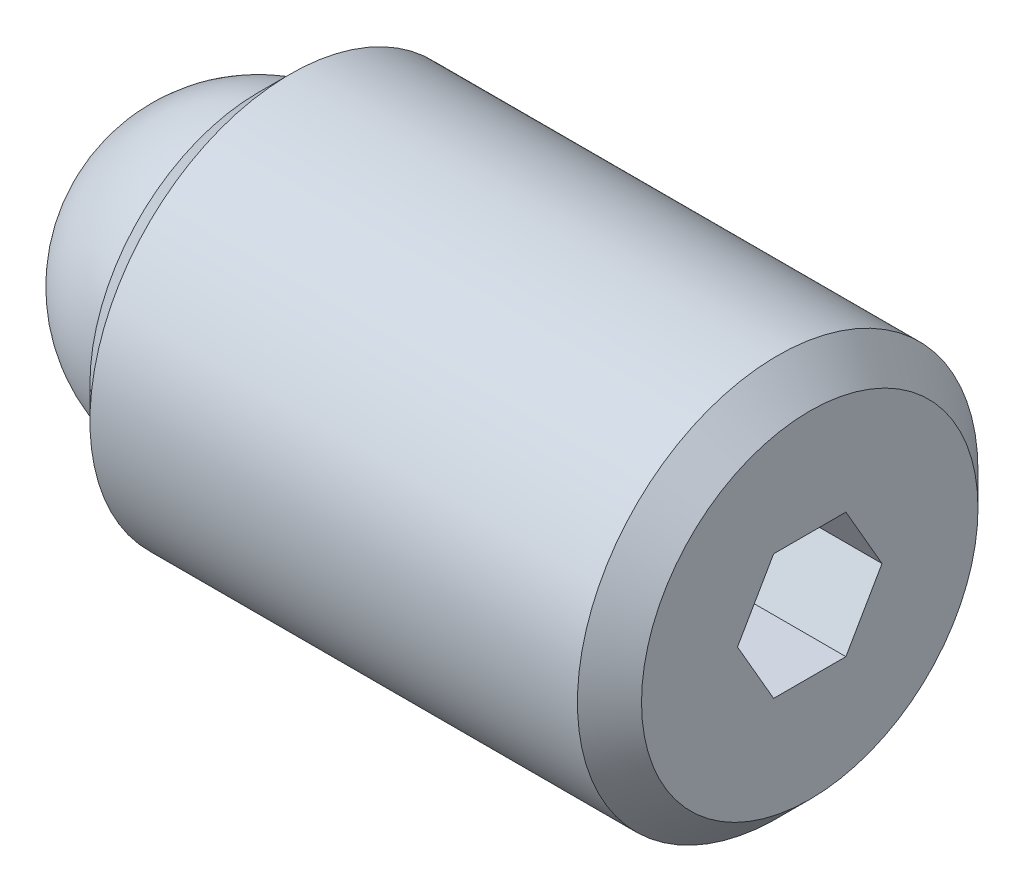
ISO-10303-21;
HEADER;
FILE_DESCRIPTION(('STEP AP214'),'2;1');
FILE_NAME('part.step','',(''),(''),'','','');
FILE_SCHEMA(('AUTOMOTIVE_DESIGN { 1 0 10303 214 1 1 1 1 }'));
ENDSEC;
DATA;
#1=APPLICATION_CONTEXT('core data for automotive mechanical design processes');
#2=APPLICATION_PROTOCOL_DEFINITION('international standard','automotive_design',2000,#1);
#3=PRODUCT_CONTEXT('',#1,'mechanical');
#4=PRODUCT('Part','Part','',(#3));
#5=PRODUCT_RELATED_PRODUCT_CATEGORY('part','',(#4));
#6=PRODUCT_DEFINITION_FORMATION('','',#4);
#7=PRODUCT_DEFINITION_CONTEXT('part definition',#1,'design');
#8=PRODUCT_DEFINITION('design','',#6,#7);
#9=PRODUCT_DEFINITION_SHAPE('','',#8);
#10=(LENGTH_UNIT() NAMED_UNIT(*) SI_UNIT(.MILLI.,.METRE.));
#11=(NAMED_UNIT(*) PLANE_ANGLE_UNIT() SI_UNIT($,.RADIAN.));
#12=(NAMED_UNIT(*) SI_UNIT($,.STERADIAN.) SOLID_ANGLE_UNIT());
#13=UNCERTAINTY_MEASURE_WITH_UNIT(LENGTH_MEASURE(1.E-05),#10,'distance_accuracy_value','');
#14=(GEOMETRIC_REPRESENTATION_CONTEXT(3) GLOBAL_UNCERTAINTY_ASSIGNED_CONTEXT((#13)) GLOBAL_UNIT_ASSIGNED_CONTEXT((#10,
#11,#12)) REPRESENTATION_CONTEXT('',''));
#15=CARTESIAN_POINT('',(0.,0.,0.));
#16=DIRECTION('',(0.,0.,1.));
#17=DIRECTION('',(1.,0.,0.));
#18=AXIS2_PLACEMENT_3D('',#15,#16,#17);
#19=CARTESIAN_POINT('',(0.,0.,0.));
#20=DIRECTION('',(0.,-1.,0.));
#21=DIRECTION('',(0.,0.,1.));
#22=AXIS2_PLACEMENT_3D('',#19,#20,#21);
#23=SPHERICAL_SURFACE('',#22,2.38125);
#24=CARTESIAN_POINT('',(0.,-2.38125,0.));
#25=VERTEX_POINT('',#24);
#26=VERTEX_LOOP('',#25);
#27=FACE_BOUND('',#26,.T.);
#28=ADVANCED_FACE('F41',(#27),#23,.T.);
#29=CLOSED_SHELL('',(#28));
#30=MANIFOLD_SOLID_BREP('B2',#29);
#31=CARTESIAN_POINT('',(8.74395,0.,0.));
#32=DIRECTION('',(-1.,0.,0.));
#33=DIRECTION('',(0.,0.,1.));
#34=AXIS2_PLACEMENT_3D('',#31,#32,#33);
#35=CYLINDRICAL_SURFACE('',#34,3.175);
#36=CARTESIAN_POINT('',(8.23595,0.,0.));
#37=DIRECTION('',(1.,0.,0.));
#38=DIRECTION('',(0.,0.,-1.));
#39=AXIS2_PLACEMENT_3D('',#36,#37,#38);
#40=CIRCLE('',#39,3.175);
#41=CARTESIAN_POINT('',(8.23595,0.,-3.175));
#42=VERTEX_POINT('',#41);
#43=EDGE_CURVE('E39',#42,#42,#40,.F.);
#44=ORIENTED_EDGE('',*,*,#43,.T.);
#45=EDGE_LOOP('',(#44));
#46=FACE_BOUND('',#45,.T.);
#47=CARTESIAN_POINT('',(0.507999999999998,0.,0.));
#48=DIRECTION('',(1.,0.,0.));
#49=DIRECTION('',(0.,0.,-1.));
#50=AXIS2_PLACEMENT_3D('',#47,#48,#49);
#51=CIRCLE('',#50,3.175);
#52=CARTESIAN_POINT('',(0.507999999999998,0.,-3.175));
#53=VERTEX_POINT('',#52);
#54=EDGE_CURVE('E157',#53,#53,#51,.T.);
#55=ORIENTED_EDGE('',*,*,#54,.T.);
#56=EDGE_LOOP('',(#55));
#57=FACE_BOUND('',#56,.T.);
#58=ADVANCED_FACE('F54',(#46,#57),#35,.T.);
#59=CARTESIAN_POINT('',(8.74395,0.,0.));
#60=DIRECTION('',(1.,0.,0.));
#61=DIRECTION('',(0.,0.,-1.));
#62=AXIS2_PLACEMENT_3D('',#59,#60,#61);
#63=PLANE('',#62);
#64=DIRECTION('',(0.,0.866025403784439,-0.5));
#65=VECTOR('',#64,1.);
#66=CARTESIAN_POINT('',(8.74395,-0.9921875,-0.572839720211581));
#67=LINE('',#66,#65);
#68=CARTESIAN_POINT('',(8.74395,-0.9921875,-0.572839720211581));
#69=VERTEX_POINT('',#68);
#70=CARTESIAN_POINT('',(8.74395,0.,-1.14567944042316));
#71=VERTEX_POINT('',#70);
#72=EDGE_CURVE('E69',#69,#71,#67,.T.);
#73=ORIENTED_EDGE('',*,*,#72,.F.);
#74=DIRECTION('',(0.,0.,-1.));
#75=VECTOR('',#74,1.);
#76=CARTESIAN_POINT('',(8.74395,-0.9921875,0.572839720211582));
#77=LINE('',#76,#75);
#78=CARTESIAN_POINT('',(8.74395,-0.9921875,0.572839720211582));
#79=VERTEX_POINT('',#78);
#80=EDGE_CURVE('E153',#79,#69,#77,.T.);
#81=ORIENTED_EDGE('',*,*,#80,.F.);
#82=DIRECTION('',(0.,-0.866025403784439,-0.5));
#83=VECTOR('',#82,1.);
#84=CARTESIAN_POINT('',(8.74395,0.,1.14567944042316));
#85=LINE('',#84,#83);
#86=CARTESIAN_POINT('',(8.74395,0.,1.14567944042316));
#87=VERTEX_POINT('',#86);
#88=EDGE_CURVE('E151',#87,#79,#85,.T.);
#89=ORIENTED_EDGE('',*,*,#88,.F.);
#90=DIRECTION('',(0.,-0.866025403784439,0.5));
#91=VECTOR('',#90,1.);
#92=CARTESIAN_POINT('',(8.74395,0.992187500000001,0.572839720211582));
#93=LINE('',#92,#91);
#94=CARTESIAN_POINT('',(8.74395,0.992187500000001,0.572839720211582));
#95=VERTEX_POINT('',#94);
#96=EDGE_CURVE('E117',#95,#87,#93,.T.);
#97=ORIENTED_EDGE('',*,*,#96,.F.);
#98=DIRECTION('',(0.,0.,1.));
#99=VECTOR('',#98,1.);
#100=CARTESIAN_POINT('',(8.74395,0.9921875,-0.572839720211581));
#101=LINE('',#100,#99);
#102=CARTESIAN_POINT('',(8.74395,0.9921875,-0.572839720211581));
#103=VERTEX_POINT('',#102);
#104=EDGE_CURVE('E147',#103,#95,#101,.T.);
#105=ORIENTED_EDGE('',*,*,#104,.F.);
#106=DIRECTION('',(0.,0.866025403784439,0.5));
#107=VECTOR('',#106,1.);
#108=CARTESIAN_POINT('',(8.74395,0.,-1.14567944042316));
#109=LINE('',#108,#107);
#110=EDGE_CURVE('E143',#71,#103,#109,.T.);
#111=ORIENTED_EDGE('',*,*,#110,.F.);
#112=EDGE_LOOP('',(#73,#81,#89,#97,#105,#111));
#113=FACE_BOUND('',#112,.T.);
#114=CARTESIAN_POINT('',(8.74395,0.,0.));
#115=DIRECTION('',(1.,0.,0.));
#116=DIRECTION('',(0.,0.,-1.));
#117=AXIS2_PLACEMENT_3D('',#114,#115,#116);
#118=CIRCLE('',#117,2.667);
#119=CARTESIAN_POINT('',(8.74395,0.,-2.667));
#120=VERTEX_POINT('',#119);
#121=EDGE_CURVE('E62',#120,#120,#118,.T.);
#122=ORIENTED_EDGE('',*,*,#121,.T.);
#123=EDGE_LOOP('',(#122));
#124=FACE_BOUND('',#123,.T.);
#125=ADVANCED_FACE('F170',(#113,#124),#63,.T.);
#126=CARTESIAN_POINT('',(0.,0.,0.));
#127=DIRECTION('',(1.,0.,0.));
#128=DIRECTION('',(0.,0.,-1.));
#129=AXIS2_PLACEMENT_3D('',#126,#127,#128);
#130=PLANE('',#129);
#131=CARTESIAN_POINT('',(0.,0.,0.));
#132=DIRECTION('',(-1.,0.,0.));
#133=DIRECTION('',(0.,0.,1.));
#134=AXIS2_PLACEMENT_3D('',#131,#132,#133);
#135=CIRCLE('',#134,2.38125);
#136=CARTESIAN_POINT('',(0.,0.,2.38125));
#137=VERTEX_POINT('',#136);
#138=EDGE_CURVE('E225',#137,#137,#135,.T.);
#139=ORIENTED_EDGE('',*,*,#138,.F.);
#140=EDGE_LOOP('',(#139));
#141=FACE_BOUND('',#140,.T.);
#142=CARTESIAN_POINT('',(0.,0.,0.));
#143=DIRECTION('',(1.,0.,0.));
#144=DIRECTION('',(0.,0.,-1.));
#145=AXIS2_PLACEMENT_3D('',#142,#143,#144);
#146=CIRCLE('',#145,2.667);
#147=CARTESIAN_POINT('',(0.,0.,-2.667));
#148=VERTEX_POINT('',#147);
#149=EDGE_CURVE('E165',#148,#148,#146,.F.);
#150=ORIENTED_EDGE('',*,*,#149,.T.);
#151=EDGE_LOOP('',(#150));
#152=FACE_BOUND('',#151,.T.);
#153=ADVANCED_FACE('F182',(#141,#152),#130,.F.);
#154=CARTESIAN_POINT('',(0.507999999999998,0.,0.));
#155=DIRECTION('',(1.,0.,0.));
#156=DIRECTION('',(0.,0.,-1.));
#157=AXIS2_PLACEMENT_3D('',#154,#155,#156);
#158=CONICAL_SURFACE('',#157,3.175,0.78539816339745);
#159=ORIENTED_EDGE('',*,*,#149,.F.);
#160=EDGE_LOOP('',(#159));
#161=FACE_BOUND('',#160,.T.);
#162=ORIENTED_EDGE('',*,*,#54,.F.);
#163=EDGE_LOOP('',(#162));
#164=FACE_BOUND('',#163,.T.);
#165=ADVANCED_FACE('F174',(#161,#164),#158,.T.);
#166=CARTESIAN_POINT('',(8.74395,0.,0.));
#167=DIRECTION('',(-1.,0.,0.));
#168=DIRECTION('',(0.,0.,1.));
#169=AXIS2_PLACEMENT_3D('',#166,#167,#168);
#170=CONICAL_SURFACE('',#169,2.667,0.785398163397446);
#171=ORIENTED_EDGE('',*,*,#43,.F.);
#172=EDGE_LOOP('',(#171));
#173=FACE_BOUND('',#172,.T.);
#174=ORIENTED_EDGE('',*,*,#121,.F.);
#175=EDGE_LOOP('',(#174));
#176=FACE_BOUND('',#175,.T.);
#177=ADVANCED_FACE('F56',(#173,#176),#170,.T.);
#178=CARTESIAN_POINT('',(6.45795,-0.9921875,-0.572839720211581));
#179=DIRECTION('',(0.,-0.5,-0.866025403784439));
#180=DIRECTION('',(0.,0.866025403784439,-0.5));
#181=AXIS2_PLACEMENT_3D('',#178,#179,#180);
#182=PLANE('',#181);
#183=ORIENTED_EDGE('',*,*,#72,.T.);
#184=DIRECTION('',(1.,0.,0.));
#185=VECTOR('',#184,1.);
#186=CARTESIAN_POINT('',(6.45795,0.,-1.14567944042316));
#187=LINE('',#186,#185);
#188=CARTESIAN_POINT('',(6.45795,0.,-1.14567944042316));
#189=VERTEX_POINT('',#188);
#190=EDGE_CURVE('E99',#189,#71,#187,.T.);
#191=ORIENTED_EDGE('',*,*,#190,.F.);
#192=DIRECTION('',(0.,0.866025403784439,-0.5));
#193=VECTOR('',#192,1.);
#194=CARTESIAN_POINT('',(6.45795,-0.9921875,-0.572839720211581));
#195=LINE('',#194,#193);
#196=CARTESIAN_POINT('',(6.45795,-0.9921875,-0.572839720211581));
#197=VERTEX_POINT('',#196);
#198=EDGE_CURVE('E155',#197,#189,#195,.T.);
#199=ORIENTED_EDGE('',*,*,#198,.F.);
#200=DIRECTION('',(1.,0.,0.));
#201=VECTOR('',#200,1.);
#202=CARTESIAN_POINT('',(6.45795,-0.9921875,-0.572839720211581));
#203=LINE('',#202,#201);
#204=EDGE_CURVE('E77',#197,#69,#203,.T.);
#205=ORIENTED_EDGE('',*,*,#204,.T.);
#206=EDGE_LOOP('',(#183,#191,#199,#205));
#207=FACE_BOUND('',#206,.T.);
#208=ADVANCED_FACE('F173',(#207),#182,.F.);
#209=CARTESIAN_POINT('',(6.45795,-0.9921875,0.572839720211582));
#210=DIRECTION('',(0.,-1.,0.));
#211=DIRECTION('',(0.,0.,-1.));
#212=AXIS2_PLACEMENT_3D('',#209,#210,#211);
#213=PLANE('',#212);
#214=ORIENTED_EDGE('',*,*,#80,.T.);
#215=ORIENTED_EDGE('',*,*,#204,.F.);
#216=DIRECTION('',(0.,0.,-1.));
#217=VECTOR('',#216,1.);
#218=CARTESIAN_POINT('',(6.45795,-0.9921875,0.572839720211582));
#219=LINE('',#218,#217);
#220=CARTESIAN_POINT('',(6.45795,-0.9921875,0.572839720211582));
#221=VERTEX_POINT('',#220);
#222=EDGE_CURVE('E129',#221,#197,#219,.T.);
#223=ORIENTED_EDGE('',*,*,#222,.F.);
#224=DIRECTION('',(1.,0.,0.));
#225=VECTOR('',#224,1.);
#226=CARTESIAN_POINT('',(6.45795,-0.9921875,0.572839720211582));
#227=LINE('',#226,#225);
#228=EDGE_CURVE('E121',#221,#79,#227,.T.);
#229=ORIENTED_EDGE('',*,*,#228,.T.);
#230=EDGE_LOOP('',(#214,#215,#223,#229));
#231=FACE_BOUND('',#230,.T.);
#232=ADVANCED_FACE('F180',(#231),#213,.F.);
#233=CARTESIAN_POINT('',(6.45795,0.,1.14567944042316));
#234=DIRECTION('',(0.,-0.5,0.866025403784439));
#235=DIRECTION('',(0.,-0.866025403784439,-0.5));
#236=AXIS2_PLACEMENT_3D('',#233,#234,#235);
#237=PLANE('',#236);
#238=ORIENTED_EDGE('',*,*,#88,.T.);
#239=ORIENTED_EDGE('',*,*,#228,.F.);
#240=DIRECTION('',(0.,-0.866025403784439,-0.5));
#241=VECTOR('',#240,1.);
#242=CARTESIAN_POINT('',(6.45795,0.,1.14567944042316));
#243=LINE('',#242,#241);
#244=CARTESIAN_POINT('',(6.45795,0.,1.14567944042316));
#245=VERTEX_POINT('',#244);
#246=EDGE_CURVE('E125',#245,#221,#243,.T.);
#247=ORIENTED_EDGE('',*,*,#246,.F.);
#248=DIRECTION('',(1.,0.,0.));
#249=VECTOR('',#248,1.);
#250=CARTESIAN_POINT('',(6.45795,0.,1.14567944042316));
#251=LINE('',#250,#249);
#252=EDGE_CURVE('E110',#245,#87,#251,.T.);
#253=ORIENTED_EDGE('',*,*,#252,.T.);
#254=EDGE_LOOP('',(#238,#239,#247,#253));
#255=FACE_BOUND('',#254,.T.);
#256=ADVANCED_FACE('F126',(#255),#237,.F.);
#257=CARTESIAN_POINT('',(6.45795,0.992187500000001,0.572839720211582));
#258=DIRECTION('',(0.,0.5,0.866025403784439));
#259=DIRECTION('',(0.,-0.866025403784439,0.5));
#260=AXIS2_PLACEMENT_3D('',#257,#258,#259);
#261=PLANE('',#260);
#262=ORIENTED_EDGE('',*,*,#96,.T.);
#263=ORIENTED_EDGE('',*,*,#252,.F.);
#264=DIRECTION('',(0.,-0.866025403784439,0.5));
#265=VECTOR('',#264,1.);
#266=CARTESIAN_POINT('',(6.45795,0.992187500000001,0.572839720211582));
#267=LINE('',#266,#265);
#268=CARTESIAN_POINT('',(6.45795,0.992187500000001,0.572839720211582));
#269=VERTEX_POINT('',#268);
#270=EDGE_CURVE('E114',#269,#245,#267,.T.);
#271=ORIENTED_EDGE('',*,*,#270,.F.);
#272=DIRECTION('',(1.,0.,0.));
#273=VECTOR('',#272,1.);
#274=CARTESIAN_POINT('',(6.45795,0.992187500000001,0.572839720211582));
#275=LINE('',#274,#273);
#276=EDGE_CURVE('E122',#269,#95,#275,.T.);
#277=ORIENTED_EDGE('',*,*,#276,.T.);
#278=EDGE_LOOP('',(#262,#263,#271,#277));
#279=FACE_BOUND('',#278,.T.);
#280=ADVANCED_FACE('F112',(#279),#261,.F.);
#281=CARTESIAN_POINT('',(6.45795,0.9921875,-0.572839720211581));
#282=DIRECTION('',(0.,1.,0.));
#283=DIRECTION('',(0.,0.,1.));
#284=AXIS2_PLACEMENT_3D('',#281,#282,#283);
#285=PLANE('',#284);
#286=ORIENTED_EDGE('',*,*,#104,.T.);
#287=ORIENTED_EDGE('',*,*,#276,.F.);
#288=DIRECTION('',(0.,0.,1.));
#289=VECTOR('',#288,1.);
#290=CARTESIAN_POINT('',(6.45795,0.9921875,-0.572839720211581));
#291=LINE('',#290,#289);
#292=CARTESIAN_POINT('',(6.45795,0.9921875,-0.572839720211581));
#293=VERTEX_POINT('',#292);
#294=EDGE_CURVE('E135',#293,#269,#291,.T.);
#295=ORIENTED_EDGE('',*,*,#294,.F.);
#296=DIRECTION('',(1.,0.,0.));
#297=VECTOR('',#296,1.);
#298=CARTESIAN_POINT('',(6.45795,0.9921875,-0.572839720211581));
#299=LINE('',#298,#297);
#300=EDGE_CURVE('E160',#293,#103,#299,.T.);
#301=ORIENTED_EDGE('',*,*,#300,.T.);
#302=EDGE_LOOP('',(#286,#287,#295,#301));
#303=FACE_BOUND('',#302,.T.);
#304=ADVANCED_FACE('F201',(#303),#285,.F.);
#305=CARTESIAN_POINT('',(6.45795,0.,-1.14567944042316));
#306=DIRECTION('',(0.,0.5,-0.866025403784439));
#307=DIRECTION('',(0.,0.866025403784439,0.5));
#308=AXIS2_PLACEMENT_3D('',#305,#306,#307);
#309=PLANE('',#308);
#310=ORIENTED_EDGE('',*,*,#110,.T.);
#311=ORIENTED_EDGE('',*,*,#300,.F.);
#312=DIRECTION('',(0.,0.866025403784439,0.5));
#313=VECTOR('',#312,1.);
#314=CARTESIAN_POINT('',(6.45795,0.,-1.14567944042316));
#315=LINE('',#314,#313);
#316=EDGE_CURVE('E137',#189,#293,#315,.T.);
#317=ORIENTED_EDGE('',*,*,#316,.F.);
#318=ORIENTED_EDGE('',*,*,#190,.T.);
#319=EDGE_LOOP('',(#310,#311,#317,#318));
#320=FACE_BOUND('',#319,.T.);
#321=ADVANCED_FACE('F198',(#320),#309,.F.);
#322=CARTESIAN_POINT('',(6.45795,0.,0.));
#323=DIRECTION('',(1.,0.,0.));
#324=DIRECTION('',(0.,0.,-1.));
#325=AXIS2_PLACEMENT_3D('',#322,#323,#324);
#326=PLANE('',#325);
#327=ORIENTED_EDGE('',*,*,#198,.T.);
#328=ORIENTED_EDGE('',*,*,#316,.T.);
#329=ORIENTED_EDGE('',*,*,#294,.T.);
#330=ORIENTED_EDGE('',*,*,#270,.T.);
#331=ORIENTED_EDGE('',*,*,#246,.T.);
#332=ORIENTED_EDGE('',*,*,#222,.T.);
#333=EDGE_LOOP('',(#327,#328,#329,#330,#331,#332));
#334=FACE_BOUND('',#333,.T.);
#335=ADVANCED_FACE('F132',(#334),#326,.T.);
#336=CARTESIAN_POINT('',(1.984375,0.,0.));
#337=DIRECTION('',(-1.,0.,0.));
#338=DIRECTION('',(0.,0.,1.));
#339=AXIS2_PLACEMENT_3D('',#336,#337,#338);
#340=CYLINDRICAL_SURFACE('',#339,2.38125);
#341=CARTESIAN_POINT('',(1.984375,0.,0.));
#342=DIRECTION('',(-1.,0.,0.));
#343=DIRECTION('',(0.,0.,1.));
#344=AXIS2_PLACEMENT_3D('',#341,#342,#343);
#345=CIRCLE('',#344,2.38125);
#346=CARTESIAN_POINT('',(1.984375,0.,2.38125));
#347=VERTEX_POINT('',#346);
#348=EDGE_CURVE('E144',#347,#347,#345,.T.);
#349=ORIENTED_EDGE('',*,*,#348,.F.);
#350=EDGE_LOOP('',(#349));
#351=FACE_BOUND('',#350,.T.);
#352=ORIENTED_EDGE('',*,*,#138,.T.);
#353=EDGE_LOOP('',(#352));
#354=FACE_BOUND('',#353,.T.);
#355=ADVANCED_FACE('F214',(#351,#354),#340,.F.);
#356=CARTESIAN_POINT('',(1.984375,0.,0.));
#357=DIRECTION('',(-1.,0.,0.));
#358=DIRECTION('',(0.,0.,1.));
#359=AXIS2_PLACEMENT_3D('',#356,#357,#358);
#360=PLANE('',#359);
#361=ORIENTED_EDGE('',*,*,#348,.T.);
#362=EDGE_LOOP('',(#361));
#363=FACE_BOUND('',#362,.T.);
#364=ADVANCED_FACE('F217',(#363),#360,.T.);
#365=CLOSED_SHELL('',(#58,#125,#153,#165,#177,#208,#232,#256,#280,#304,#321,#335,#355,#364));
#366=MANIFOLD_SOLID_BREP('B6',#365);
#367=ADVANCED_BREP_SHAPE_REPRESENTATION('',(#18,#30,#366),#14);
#368=SHAPE_DEFINITION_REPRESENTATION(#9,#367);
ENDSEC;
END-ISO-10303-21;
